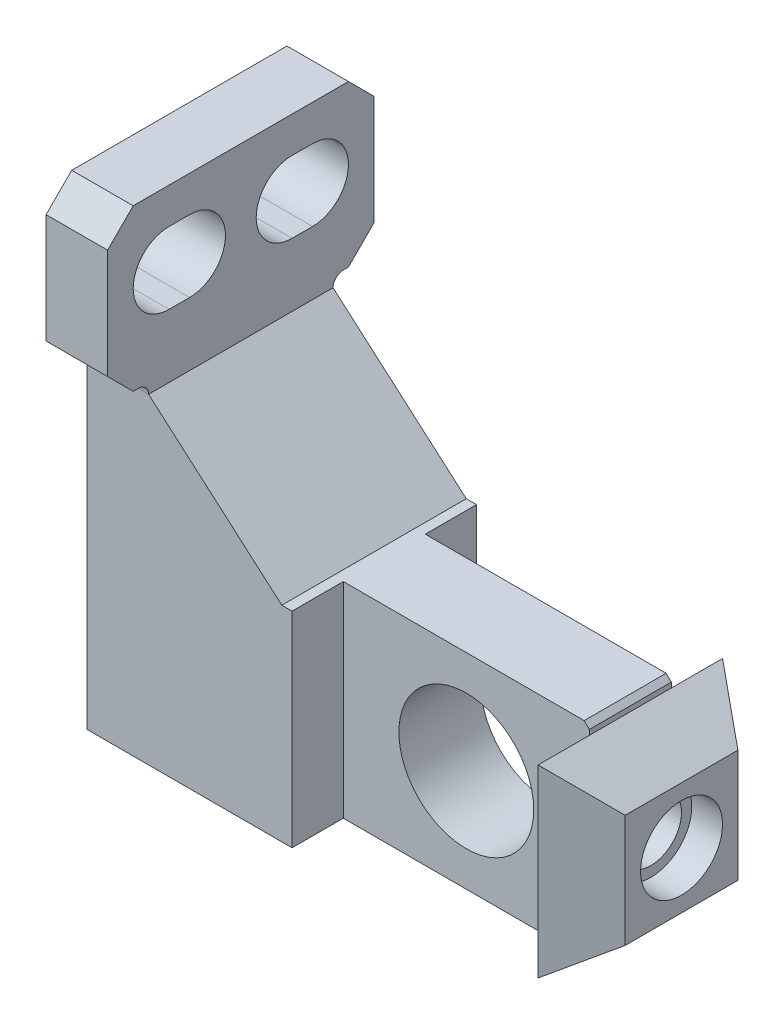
from build123d import *

# Parameters (mm, degrees)
EXTRUDE_1_DEPTH          = 4
EXTRUDE_1_DEPTH_BACK     = 4
SKETCH_2_W               = 8
SKETCH_2_H               = 6.5785
EXTRUDE_2_DEPTH          = 9
EXTRUDE_2_DEPTH_BACK     = 9
CUT_EXTRUDE_1_DEPTH      = 9
CUT_EXTRUDE_1_DEPTH_BACK = 9
EXTRUDE_3_DEPTH          = 9
EXTRUDE_3_DEPTH_BACK     = 9
EXTRUDE_4_DEPTH          = 6


with BuildPart() as part:
    # Sketch 1 → Extrude 1 (new, two sides: drawn at the far end of the back side and taken through both)
    with BuildSketch(Plane.XY.offset(-EXTRUDE_1_DEPTH_BACK)):
        Polygon((-12, -10), (11.5, -10), (12, -9.5), (12, 9.5), (11.5, 10), (-12, 10), align=None)
    extrude(amount=EXTRUDE_1_DEPTH + EXTRUDE_1_DEPTH_BACK)

    # Sketch 2 → Cut-Revolve 1 (revolve, cut)
    with BuildSketch(Plane(origin=(0, 0, 0), x_dir=(0, 0, -1), z_dir=(1, 0, 0)), mode=Mode.PRIVATE) as cut_revolve_1_sk:
        with Locations((0, 3.28925)):
            Rectangle(SKETCH_2_W, SKETCH_2_H)
    revolve(cut_revolve_1_sk.sketch.rotate(Axis((0, 0, -4), (0, 0, 1)), 270), axis=Axis((0, 0, -4), (0, 0, 1)), mode=Mode.SUBTRACT)

    # Sketch 3 → Extrude 2 (add, two sides: drawn at the far end of the back side and taken through both)
    with BuildSketch(Plane.XY.offset(-EXTRUDE_2_DEPTH_BACK)):
        Polygon((12, 9), (12, -9), (17, -5.5), (17, 5.5), align=None)
    extrude(amount=EXTRUDE_2_DEPTH + EXTRUDE_2_DEPTH_BACK)

    # Sketch 4 → Cut-Extrude 1 (cut, two sides: drawn at the far end of the back side and taken through both)
    with BuildSketch(Plane(origin=(0, 0, 0), x_dir=(1, 0, 0), z_dir=(0, 1, 0)).offset(-CUT_EXTRUDE_1_DEPTH_BACK)):
        Polygon((12, 9), (17, 5.5), (17, -5.5), (12, -9), (22, -9), (22, 9), align=None)
    extrude(amount=CUT_EXTRUDE_1_DEPTH + CUT_EXTRUDE_1_DEPTH_BACK, mode=Mode.SUBTRACT)

    # Sketch 5 → Cut-Revolve 2 (revolve, cut)
    with BuildSketch(Plane.XY, mode=Mode.PRIVATE) as cut_revolve_2_sk:
        Polygon((9, 0), (9, 3), (14, 3), (14, 4), (17, 4), (17, 0), align=None)
    revolve(cut_revolve_2_sk.sketch.rotate(Axis((17, 0, 0), (-1, 0, 0)), 270), axis=Axis((17, 0, 0), (-1, 0, 0)), mode=Mode.SUBTRACT)

    # Sketch 6 → Extrude 3 (add, two sides: drawn at the far end of the back side and taken through both)
    with BuildSketch(Plane.XY.offset(-EXTRUDE_3_DEPTH_BACK)):
        Polygon((-32, 21.32), (-32, -10), (-12, -10), (-12, 10), (-13, 10), (-26, 21.32), align=None)
    extrude(amount=EXTRUDE_3_DEPTH + EXTRUDE_3_DEPTH_BACK)

    # Sketch 7 → Extrude 4 (add)
    with BuildSketch(Plane(origin=(-32, 0, 0), x_dir=(0, 0, -1), z_dir=(1, 0, 0))):
        with BuildLine():
            Line((-13, 35.5), (-13, 24.82))
            Line((-13, 24.82), (-10.5, 22.32))
            Line((-10.5, 22.32), (-10, 22.32))
            ThreePointArc((-10, 22.32), (-9.292893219, 22.027106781), (-9, 21.32))
            Line((-9, 21.32), (9, 21.32))
            ThreePointArc((9, 21.32), (9.292893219, 22.027106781), (10, 22.32))
            Line((10, 22.32), (10.5, 22.32))
            Line((10.5, 22.32), (13, 24.82))
            Line((13, 24.82), (13, 35.5))
            Line((13, 35.5), (10.5, 38))
            Line((10.5, 38), (-10.5, 38))
            Line((-10.5, 38), (-13, 35.5))
        make_face()
        with BuildLine():
            Line((5, 27.5), (7, 27.5))
            ThreePointArc((7, 27.5), (10.5, 31), (7, 34.5))
            Line((7, 34.5), (5, 34.5))
            ThreePointArc((5, 34.5), (1.5, 31), (5, 27.5))
        make_face(mode=Mode.SUBTRACT)
        with BuildLine():
            Line((-7, 27.5), (-5, 27.5))
            ThreePointArc((-5, 27.5), (-1.5, 31), (-5, 34.5))
            Line((-5, 34.5), (-7, 34.5))
            ThreePointArc((-7, 34.5), (-10.5, 31), (-7, 27.5))
        make_face(mode=Mode.SUBTRACT)
    extrude(amount=EXTRUDE_4_DEPTH)


solid = part.part
